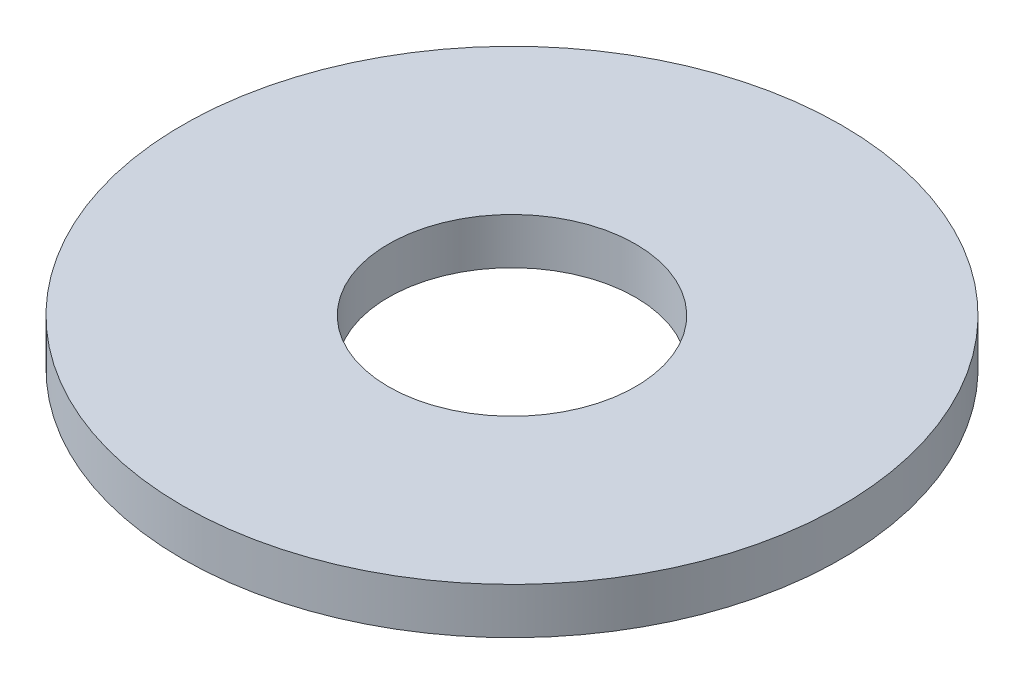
from build123d import *

# Parameters (mm, degrees)
SKETCH1_R      = 12.7
SKETCH1_R_2    = 4.7625
EXTRUDE1_DEPTH = 1.778


with BuildPart() as part:
    # Sketch1 → Extrude1 (new body)
    with BuildSketch(Plane(origin=(0, 0, 0), x_dir=(1, 0, 0), z_dir=(0, 1, 0))):
        with Locations(Location((0, 0, 0), (0, 0, 270))):
            Circle(SKETCH1_R)
        with Locations(Location((0, 0, 0), (0, 0, 270))):
            Circle(SKETCH1_R_2, mode=Mode.SUBTRACT)
    extrude(amount=EXTRUDE1_DEPTH)


solid = part.part
